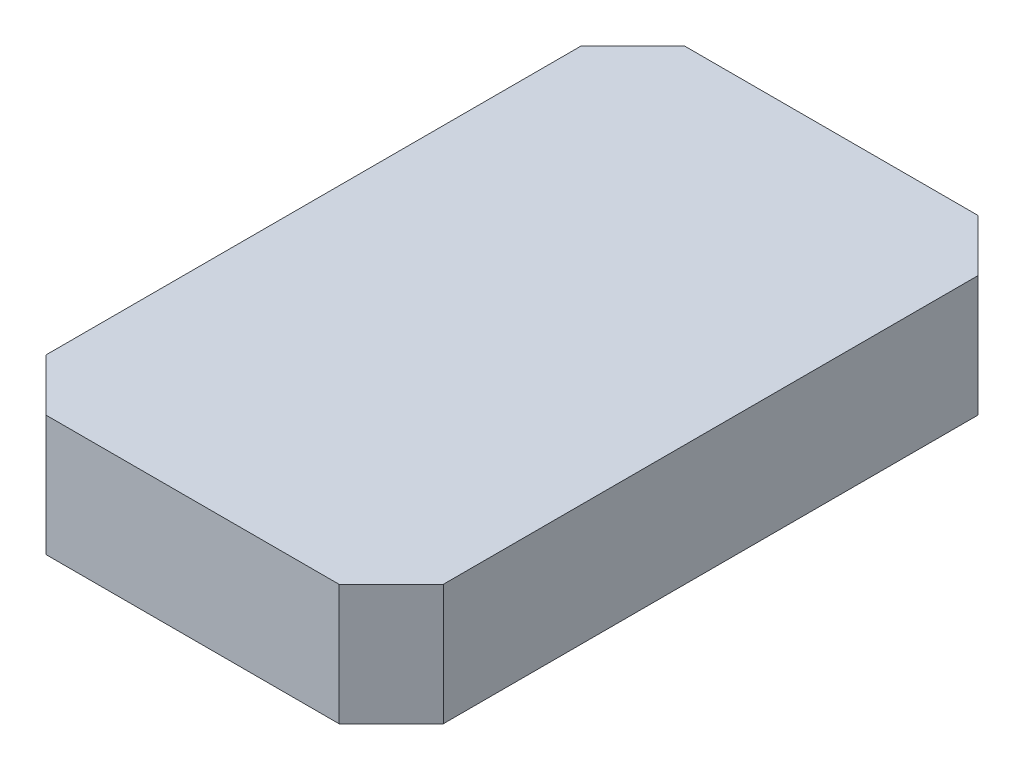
from build123d import *

# Parameters (mm, degrees)
BOSS_EXTRUDE1_DEPTH = 4.5


with BuildPart() as part:
    # Sketch2 → Boss-Extrude1 (new body)
    with BuildSketch(Plane(origin=(0, 0, 0), x_dir=(1, 0, 0), z_dir=(0, 1, 0))):
        Polygon((5.458578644, 15.9), (-5.458578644, 15.9), (-7.4, 13.958578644), (-7.4, -5.958578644), (-5.458578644, -7.9), (5.458578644, -7.9), (7.4, -5.958578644), (7.4, 13.958578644), align=None)
    extrude(amount=BOSS_EXTRUDE1_DEPTH)


solid = part.part
